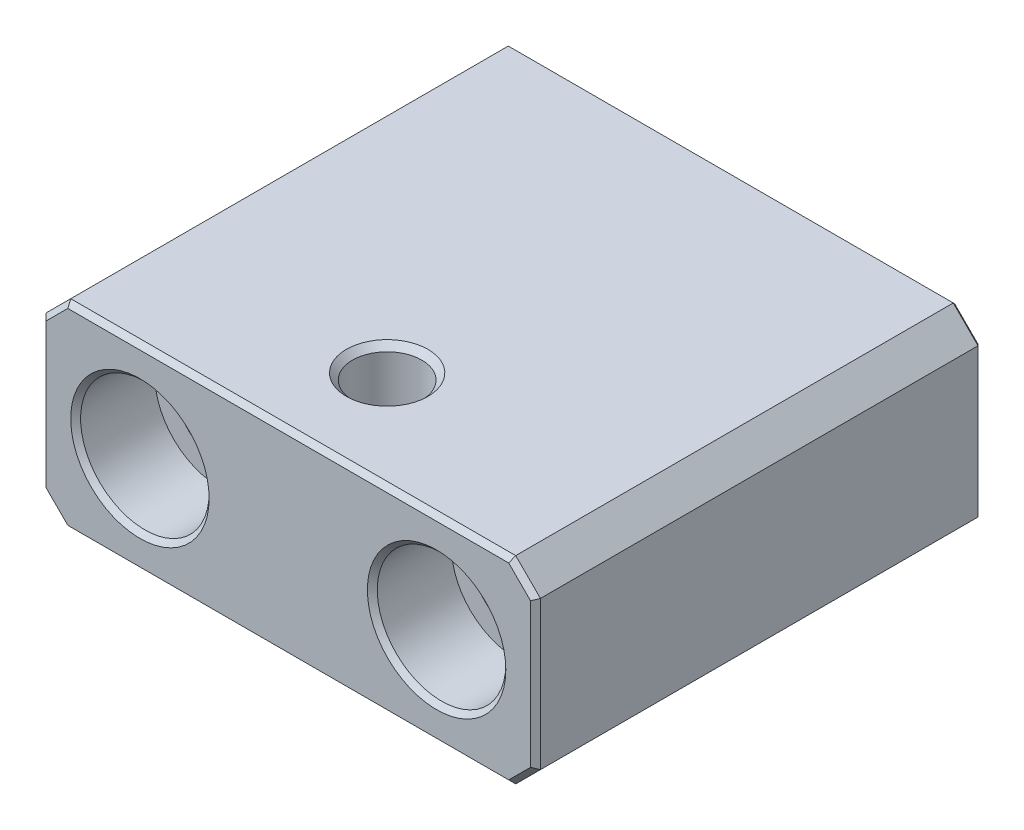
ISO-10303-21;
HEADER;
FILE_DESCRIPTION(('STEP AP214'),'2;1');
FILE_NAME('part.step','',(''),(''),'','','');
FILE_SCHEMA(('AUTOMOTIVE_DESIGN { 1 0 10303 214 1 1 1 1 }'));
ENDSEC;
DATA;
#1=APPLICATION_CONTEXT('core data for automotive mechanical design processes');
#2=APPLICATION_PROTOCOL_DEFINITION('international standard','automotive_design',2000,#1);
#3=PRODUCT_CONTEXT('',#1,'mechanical');
#4=PRODUCT('Part','Part','',(#3));
#5=PRODUCT_RELATED_PRODUCT_CATEGORY('part','',(#4));
#6=PRODUCT_DEFINITION_FORMATION('','',#4);
#7=PRODUCT_DEFINITION_CONTEXT('part definition',#1,'design');
#8=PRODUCT_DEFINITION('design','',#6,#7);
#9=PRODUCT_DEFINITION_SHAPE('','',#8);
#10=(LENGTH_UNIT() NAMED_UNIT(*) SI_UNIT(.MILLI.,.METRE.));
#11=(NAMED_UNIT(*) PLANE_ANGLE_UNIT() SI_UNIT($,.RADIAN.));
#12=(NAMED_UNIT(*) SI_UNIT($,.STERADIAN.) SOLID_ANGLE_UNIT());
#13=UNCERTAINTY_MEASURE_WITH_UNIT(LENGTH_MEASURE(1.E-05),#10,'distance_accuracy_value','');
#14=(GEOMETRIC_REPRESENTATION_CONTEXT(3) GLOBAL_UNCERTAINTY_ASSIGNED_CONTEXT((#13)) GLOBAL_UNIT_ASSIGNED_CONTEXT((#10,
#11,#12)) REPRESENTATION_CONTEXT('',''));
#15=CARTESIAN_POINT('',(0.,0.,0.));
#16=DIRECTION('',(0.,0.,1.));
#17=DIRECTION('',(1.,0.,0.));
#18=AXIS2_PLACEMENT_3D('',#15,#16,#17);
#19=CARTESIAN_POINT('',(50.,40.,90.));
#20=DIRECTION('',(0.,-1.,0.));
#21=DIRECTION('',(0.,0.,-1.));
#22=AXIS2_PLACEMENT_3D('',#19,#20,#21);
#23=PLANE('',#22);
#24=CARTESIAN_POINT('',(0.,40.,70.));
#25=DIRECTION('',(0.,-1.,0.));
#26=DIRECTION('',(0.,0.,-1.));
#27=AXIS2_PLACEMENT_3D('',#24,#25,#26);
#28=CIRCLE('',#27,8.24999999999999);
#29=CARTESIAN_POINT('',(0.,40.,61.75));
#30=VERTEX_POINT('',#29);
#31=EDGE_CURVE('E226',#30,#30,#28,.T.);
#32=ORIENTED_EDGE('',*,*,#31,.T.);
#33=EDGE_LOOP('',(#32));
#34=FACE_BOUND('',#33,.T.);
#35=DIRECTION('',(0.,0.,-1.));
#36=VECTOR('',#35,1.);
#37=CARTESIAN_POINT('',(45.,40.,90.));
#38=LINE('',#37,#36);
#39=CARTESIAN_POINT('',(45.,40.,89.));
#40=VERTEX_POINT('',#39);
#41=CARTESIAN_POINT('',(45.,40.,0.5));
#42=VERTEX_POINT('',#41);
#43=EDGE_CURVE('E305',#40,#42,#38,.T.);
#44=ORIENTED_EDGE('',*,*,#43,.T.);
#45=DIRECTION('',(-1.,0.,0.));
#46=VECTOR('',#45,1.);
#47=CARTESIAN_POINT('',(50.,40.,0.5));
#48=LINE('',#47,#46);
#49=CARTESIAN_POINT('',(-45.,40.,0.5));
#50=VERTEX_POINT('',#49);
#51=EDGE_CURVE('E262',#42,#50,#48,.T.);
#52=ORIENTED_EDGE('',*,*,#51,.T.);
#53=DIRECTION('',(0.,0.,1.));
#54=VECTOR('',#53,1.);
#55=CARTESIAN_POINT('',(-45.,40.,90.));
#56=LINE('',#55,#54);
#57=CARTESIAN_POINT('',(-45.,40.,89.));
#58=VERTEX_POINT('',#57);
#59=EDGE_CURVE('E309',#50,#58,#56,.T.);
#60=ORIENTED_EDGE('',*,*,#59,.T.);
#61=DIRECTION('',(1.,0.,0.));
#62=VECTOR('',#61,1.);
#63=CARTESIAN_POINT('',(45.,40.,89.));
#64=LINE('',#63,#62);
#65=EDGE_CURVE('E195',#58,#40,#64,.T.);
#66=ORIENTED_EDGE('',*,*,#65,.T.);
#67=EDGE_LOOP('',(#44,#52,#60,#66));
#68=FACE_BOUND('',#67,.T.);
#69=ADVANCED_FACE('F34',(#34,#68),#23,.F.);
#70=CARTESIAN_POINT('',(-50.,40.,90.));
#71=DIRECTION('',(1.,0.,0.));
#72=DIRECTION('',(0.,0.,-1.));
#73=AXIS2_PLACEMENT_3D('',#70,#71,#72);
#74=PLANE('',#73);
#75=DIRECTION('',(0.,0.,-1.));
#76=VECTOR('',#75,1.);
#77=CARTESIAN_POINT('',(-50.,35.,90.));
#78=LINE('',#77,#76);
#79=CARTESIAN_POINT('',(-50.,35.,89.));
#80=VERTEX_POINT('',#79);
#81=CARTESIAN_POINT('',(-50.,35.,0.5));
#82=VERTEX_POINT('',#81);
#83=EDGE_CURVE('E318',#80,#82,#78,.T.);
#84=ORIENTED_EDGE('',*,*,#83,.T.);
#85=DIRECTION('',(0.,-1.,0.));
#86=VECTOR('',#85,1.);
#87=CARTESIAN_POINT('',(-50.,40.,0.5));
#88=LINE('',#87,#86);
#89=CARTESIAN_POINT('',(-50.,5.00000000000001,0.5));
#90=VERTEX_POINT('',#89);
#91=EDGE_CURVE('E252',#82,#90,#88,.T.);
#92=ORIENTED_EDGE('',*,*,#91,.T.);
#93=DIRECTION('',(0.,0.,1.));
#94=VECTOR('',#93,1.);
#95=CARTESIAN_POINT('',(-50.,5.00000000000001,90.));
#96=LINE('',#95,#94);
#97=CARTESIAN_POINT('',(-50.,5.00000000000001,89.));
#98=VERTEX_POINT('',#97);
#99=EDGE_CURVE('E316',#90,#98,#96,.T.);
#100=ORIENTED_EDGE('',*,*,#99,.T.);
#101=DIRECTION('',(0.,1.,0.));
#102=VECTOR('',#101,1.);
#103=CARTESIAN_POINT('',(-50.,35.,89.));
#104=LINE('',#103,#102);
#105=EDGE_CURVE('E190',#98,#80,#104,.T.);
#106=ORIENTED_EDGE('',*,*,#105,.T.);
#107=EDGE_LOOP('',(#84,#92,#100,#106));
#108=FACE_BOUND('',#107,.T.);
#109=ADVANCED_FACE('F396',(#108),#74,.F.);
#110=CARTESIAN_POINT('',(-50.,0.,90.));
#111=DIRECTION('',(0.,1.,0.));
#112=DIRECTION('',(0.,0.,1.));
#113=AXIS2_PLACEMENT_3D('',#110,#111,#112);
#114=PLANE('',#113);
#115=CARTESIAN_POINT('',(0.,0.,70.));
#116=DIRECTION('',(0.,-1.,0.));
#117=DIRECTION('',(0.,0.,-1.));
#118=AXIS2_PLACEMENT_3D('',#115,#116,#117);
#119=CIRCLE('',#118,8.25);
#120=CARTESIAN_POINT('',(0.,0.,61.75));
#121=VERTEX_POINT('',#120);
#122=EDGE_CURVE('E515',#121,#121,#119,.T.);
#123=ORIENTED_EDGE('',*,*,#122,.F.);
#124=EDGE_LOOP('',(#123));
#125=FACE_BOUND('',#124,.T.);
#126=DIRECTION('',(0.,0.,-1.));
#127=VECTOR('',#126,1.);
#128=CARTESIAN_POINT('',(-45.,0.,90.));
#129=LINE('',#128,#127);
#130=CARTESIAN_POINT('',(-45.,0.,89.));
#131=VERTEX_POINT('',#130);
#132=CARTESIAN_POINT('',(-45.,0.,0.5));
#133=VERTEX_POINT('',#132);
#134=EDGE_CURVE('E307',#131,#133,#129,.T.);
#135=ORIENTED_EDGE('',*,*,#134,.T.);
#136=DIRECTION('',(1.,0.,0.));
#137=VECTOR('',#136,1.);
#138=CARTESIAN_POINT('',(-50.,0.,0.5));
#139=LINE('',#138,#137);
#140=CARTESIAN_POINT('',(45.,0.,0.5));
#141=VERTEX_POINT('',#140);
#142=EDGE_CURVE('E256',#133,#141,#139,.T.);
#143=ORIENTED_EDGE('',*,*,#142,.T.);
#144=DIRECTION('',(0.,0.,1.));
#145=VECTOR('',#144,1.);
#146=CARTESIAN_POINT('',(45.,0.,90.));
#147=LINE('',#146,#145);
#148=CARTESIAN_POINT('',(45.,0.,89.));
#149=VERTEX_POINT('',#148);
#150=EDGE_CURVE('E302',#141,#149,#147,.T.);
#151=ORIENTED_EDGE('',*,*,#150,.T.);
#152=DIRECTION('',(-1.,0.,0.));
#153=VECTOR('',#152,1.);
#154=CARTESIAN_POINT('',(-45.,0.,89.));
#155=LINE('',#154,#153);
#156=EDGE_CURVE('E180',#149,#131,#155,.T.);
#157=ORIENTED_EDGE('',*,*,#156,.T.);
#158=EDGE_LOOP('',(#135,#143,#151,#157));
#159=FACE_BOUND('',#158,.T.);
#160=ADVANCED_FACE('F344',(#125,#159),#114,.F.);
#161=CARTESIAN_POINT('',(50.,0.,90.));
#162=DIRECTION('',(-1.,0.,0.));
#163=DIRECTION('',(0.,0.,1.));
#164=AXIS2_PLACEMENT_3D('',#161,#162,#163);
#165=PLANE('',#164);
#166=DIRECTION('',(0.,0.,-1.));
#167=VECTOR('',#166,1.);
#168=CARTESIAN_POINT('',(50.,5.00000000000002,90.));
#169=LINE('',#168,#167);
#170=CARTESIAN_POINT('',(50.,5.00000000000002,89.));
#171=VERTEX_POINT('',#170);
#172=CARTESIAN_POINT('',(50.,5.00000000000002,0.5));
#173=VERTEX_POINT('',#172);
#174=EDGE_CURVE('E301',#171,#173,#169,.T.);
#175=ORIENTED_EDGE('',*,*,#174,.T.);
#176=DIRECTION('',(0.,1.,0.));
#177=VECTOR('',#176,1.);
#178=CARTESIAN_POINT('',(50.,0.,0.5));
#179=LINE('',#178,#177);
#180=CARTESIAN_POINT('',(50.,35.,0.5));
#181=VERTEX_POINT('',#180);
#182=EDGE_CURVE('E59',#173,#181,#179,.T.);
#183=ORIENTED_EDGE('',*,*,#182,.T.);
#184=DIRECTION('',(0.,0.,1.));
#185=VECTOR('',#184,1.);
#186=CARTESIAN_POINT('',(50.,35.,90.));
#187=LINE('',#186,#185);
#188=CARTESIAN_POINT('',(50.,35.,89.));
#189=VERTEX_POINT('',#188);
#190=EDGE_CURVE('E304',#181,#189,#187,.T.);
#191=ORIENTED_EDGE('',*,*,#190,.T.);
#192=DIRECTION('',(0.,-1.,0.));
#193=VECTOR('',#192,1.);
#194=CARTESIAN_POINT('',(50.,4.99999999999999,89.));
#195=LINE('',#194,#193);
#196=EDGE_CURVE('E200',#189,#171,#195,.T.);
#197=ORIENTED_EDGE('',*,*,#196,.T.);
#198=EDGE_LOOP('',(#175,#183,#191,#197));
#199=FACE_BOUND('',#198,.T.);
#200=ADVANCED_FACE('F303',(#199),#165,.F.);
#201=CARTESIAN_POINT('',(-50.,40.,90.));
#202=DIRECTION('',(0.,0.,1.));
#203=DIRECTION('',(1.,0.,0.));
#204=AXIS2_PLACEMENT_3D('',#201,#202,#203);
#205=PLANE('',#204);
#206=DIRECTION('',(1.,0.,0.));
#207=VECTOR('',#206,1.);
#208=CARTESIAN_POINT('',(45.,0.999999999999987,90.));
#209=LINE('',#208,#207);
#210=CARTESIAN_POINT('',(-44.5857864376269,0.999999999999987,90.));
#211=VERTEX_POINT('',#210);
#212=CARTESIAN_POINT('',(44.5857864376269,0.999999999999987,90.));
#213=VERTEX_POINT('',#212);
#214=EDGE_CURVE('E177',#211,#213,#209,.T.);
#215=ORIENTED_EDGE('',*,*,#214,.T.);
#216=DIRECTION('',(0.707106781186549,0.707106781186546,0.));
#217=VECTOR('',#216,1.);
#218=CARTESIAN_POINT('',(16.7928932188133,-26.7928932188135,90.));
#219=LINE('',#218,#217);
#220=CARTESIAN_POINT('',(49.,5.41421356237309,90.));
#221=VERTEX_POINT('',#220);
#222=EDGE_CURVE('E157',#213,#221,#219,.T.);
#223=ORIENTED_EDGE('',*,*,#222,.T.);
#224=DIRECTION('',(0.,1.,0.));
#225=VECTOR('',#224,1.);
#226=CARTESIAN_POINT('',(49.,35.,90.));
#227=LINE('',#226,#225);
#228=CARTESIAN_POINT('',(49.,34.5857864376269,90.));
#229=VERTEX_POINT('',#228);
#230=EDGE_CURVE('E165',#221,#229,#227,.T.);
#231=ORIENTED_EDGE('',*,*,#230,.T.);
#232=DIRECTION('',(-0.707106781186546,0.707106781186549,0.));
#233=VECTOR('',#232,1.);
#234=CARTESIAN_POINT('',(-3.20710678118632,86.7928932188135,90.));
#235=LINE('',#234,#233);
#236=CARTESIAN_POINT('',(44.5857864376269,39.,90.));
#237=VERTEX_POINT('',#236);
#238=EDGE_CURVE('E171',#229,#237,#235,.T.);
#239=ORIENTED_EDGE('',*,*,#238,.T.);
#240=DIRECTION('',(-1.,0.,0.));
#241=VECTOR('',#240,1.);
#242=CARTESIAN_POINT('',(-45.,39.,90.));
#243=LINE('',#242,#241);
#244=CARTESIAN_POINT('',(-44.5857864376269,39.,90.));
#245=VERTEX_POINT('',#244);
#246=EDGE_CURVE('E327',#237,#245,#243,.T.);
#247=ORIENTED_EDGE('',*,*,#246,.T.);
#248=DIRECTION('',(-0.707106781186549,-0.707106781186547,0.));
#249=VECTOR('',#248,1.);
#250=CARTESIAN_POINT('',(-46.7928932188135,36.7928932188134,90.));
#251=LINE('',#250,#249);
#252=CARTESIAN_POINT('',(-49.,34.5857864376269,90.));
#253=VERTEX_POINT('',#252);
#254=EDGE_CURVE('E329',#245,#253,#251,.T.);
#255=ORIENTED_EDGE('',*,*,#254,.T.);
#256=DIRECTION('',(0.,-1.,0.));
#257=VECTOR('',#256,1.);
#258=CARTESIAN_POINT('',(-49.,5.,90.));
#259=LINE('',#258,#257);
#260=CARTESIAN_POINT('',(-49.,5.4142135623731,90.));
#261=VERTEX_POINT('',#260);
#262=EDGE_CURVE('E331',#253,#261,#259,.T.);
#263=ORIENTED_EDGE('',*,*,#262,.T.);
#264=DIRECTION('',(0.707106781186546,-0.707106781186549,0.));
#265=VECTOR('',#264,1.);
#266=CARTESIAN_POINT('',(-66.7928932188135,23.2071067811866,90.));
#267=LINE('',#266,#265);
#268=EDGE_CURVE('E182',#261,#211,#267,.T.);
#269=ORIENTED_EDGE('',*,*,#268,.T.);
#270=EDGE_LOOP('',(#215,#223,#231,#239,#247,#255,#263,#269));
#271=FACE_BOUND('',#270,.T.);
#272=CARTESIAN_POINT('',(30.,20.,90.));
#273=DIRECTION('',(0.,0.,1.));
#274=DIRECTION('',(1.,0.,0.));
#275=AXIS2_PLACEMENT_3D('',#272,#273,#274);
#276=CIRCLE('',#275,14.);
#277=CARTESIAN_POINT('',(44.,20.,90.));
#278=VERTEX_POINT('',#277);
#279=EDGE_CURVE('E172',#278,#278,#276,.F.);
#280=ORIENTED_EDGE('',*,*,#279,.T.);
#281=EDGE_LOOP('',(#280));
#282=FACE_BOUND('',#281,.T.);
#283=CARTESIAN_POINT('',(-30.,20.,90.));
#284=DIRECTION('',(0.,0.,1.));
#285=DIRECTION('',(1.,0.,0.));
#286=AXIS2_PLACEMENT_3D('',#283,#284,#285);
#287=CIRCLE('',#286,14.);
#288=CARTESIAN_POINT('',(-16.,20.,90.));
#289=VERTEX_POINT('',#288);
#290=EDGE_CURVE('E321',#289,#289,#287,.F.);
#291=ORIENTED_EDGE('',*,*,#290,.T.);
#292=EDGE_LOOP('',(#291));
#293=FACE_BOUND('',#292,.T.);
#294=ADVANCED_FACE('F174',(#271,#282,#293),#205,.T.);
#295=CARTESIAN_POINT('',(-50.,40.,0.));
#296=DIRECTION('',(0.,0.,1.));
#297=DIRECTION('',(1.,0.,0.));
#298=AXIS2_PLACEMENT_3D('',#295,#296,#297);
#299=PLANE('',#298);
#300=DIRECTION('',(0.,1.,0.));
#301=VECTOR('',#300,1.);
#302=CARTESIAN_POINT('',(-49.5,40.,0.));
#303=LINE('',#302,#301);
#304=CARTESIAN_POINT('',(-49.5,5.20710678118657,0.));
#305=VERTEX_POINT('',#304);
#306=CARTESIAN_POINT('',(-49.5,34.7928932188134,0.));
#307=VERTEX_POINT('',#306);
#308=EDGE_CURVE('E244',#305,#307,#303,.T.);
#309=ORIENTED_EDGE('',*,*,#308,.T.);
#310=DIRECTION('',(0.707106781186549,0.707106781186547,0.));
#311=VECTOR('',#310,1.);
#312=CARTESIAN_POINT('',(-44.6464466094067,39.6464466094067,0.));
#313=LINE('',#312,#311);
#314=CARTESIAN_POINT('',(-44.7928932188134,39.5,0.));
#315=VERTEX_POINT('',#314);
#316=EDGE_CURVE('E246',#307,#315,#313,.T.);
#317=ORIENTED_EDGE('',*,*,#316,.T.);
#318=DIRECTION('',(1.,0.,0.));
#319=VECTOR('',#318,1.);
#320=CARTESIAN_POINT('',(-50.,39.5,0.));
#321=LINE('',#320,#319);
#322=CARTESIAN_POINT('',(44.7928932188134,39.5,0.));
#323=VERTEX_POINT('',#322);
#324=EDGE_CURVE('E232',#315,#323,#321,.T.);
#325=ORIENTED_EDGE('',*,*,#324,.T.);
#326=DIRECTION('',(0.707106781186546,-0.707106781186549,0.));
#327=VECTOR('',#326,1.);
#328=CARTESIAN_POINT('',(49.6464466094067,34.6464466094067,0.));
#329=LINE('',#328,#327);
#330=CARTESIAN_POINT('',(49.5,34.7928932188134,0.));
#331=VERTEX_POINT('',#330);
#332=EDGE_CURVE('E234',#323,#331,#329,.T.);
#333=ORIENTED_EDGE('',*,*,#332,.T.);
#334=DIRECTION('',(0.,-1.,0.));
#335=VECTOR('',#334,1.);
#336=CARTESIAN_POINT('',(49.5,40.,0.));
#337=LINE('',#336,#335);
#338=CARTESIAN_POINT('',(49.5,5.20710678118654,0.));
#339=VERTEX_POINT('',#338);
#340=EDGE_CURVE('E236',#331,#339,#337,.T.);
#341=ORIENTED_EDGE('',*,*,#340,.T.);
#342=DIRECTION('',(-0.707106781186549,-0.707106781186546,0.));
#343=VECTOR('',#342,1.);
#344=CARTESIAN_POINT('',(44.6464466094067,0.353553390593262,0.));
#345=LINE('',#344,#343);
#346=CARTESIAN_POINT('',(44.7928932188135,0.500000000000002,0.));
#347=VERTEX_POINT('',#346);
#348=EDGE_CURVE('E238',#339,#347,#345,.T.);
#349=ORIENTED_EDGE('',*,*,#348,.T.);
#350=DIRECTION('',(-1.,0.,0.));
#351=VECTOR('',#350,1.);
#352=CARTESIAN_POINT('',(-50.,0.5,0.));
#353=LINE('',#352,#351);
#354=CARTESIAN_POINT('',(-44.7928932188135,0.5,0.));
#355=VERTEX_POINT('',#354);
#356=EDGE_CURVE('E240',#347,#355,#353,.T.);
#357=ORIENTED_EDGE('',*,*,#356,.T.);
#358=DIRECTION('',(-0.707106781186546,0.707106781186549,0.));
#359=VECTOR('',#358,1.);
#360=CARTESIAN_POINT('',(-49.6464466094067,5.35355339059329,0.));
#361=LINE('',#360,#359);
#362=EDGE_CURVE('E242',#355,#305,#361,.T.);
#363=ORIENTED_EDGE('',*,*,#362,.T.);
#364=EDGE_LOOP('',(#309,#317,#325,#333,#341,#349,#357,#363));
#365=FACE_BOUND('',#364,.T.);
#366=CARTESIAN_POINT('',(30.,20.,0.));
#367=DIRECTION('',(0.,0.,1.));
#368=DIRECTION('',(1.,0.,0.));
#369=AXIS2_PLACEMENT_3D('',#366,#367,#368);
#370=CIRCLE('',#369,9.24999999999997);
#371=CARTESIAN_POINT('',(39.25,20.,0.));
#372=VERTEX_POINT('',#371);
#373=EDGE_CURVE('E229',#372,#372,#370,.T.);
#374=ORIENTED_EDGE('',*,*,#373,.T.);
#375=EDGE_LOOP('',(#374));
#376=FACE_BOUND('',#375,.T.);
#377=CARTESIAN_POINT('',(-30.,20.,0.));
#378=DIRECTION('',(0.,0.,1.));
#379=DIRECTION('',(1.,0.,0.));
#380=AXIS2_PLACEMENT_3D('',#377,#378,#379);
#381=CIRCLE('',#380,9.24999999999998);
#382=CARTESIAN_POINT('',(-20.75,20.,0.));
#383=VERTEX_POINT('',#382);
#384=EDGE_CURVE('E207',#383,#383,#381,.T.);
#385=ORIENTED_EDGE('',*,*,#384,.T.);
#386=EDGE_LOOP('',(#385));
#387=FACE_BOUND('',#386,.T.);
#388=ADVANCED_FACE('F361',(#365,#376,#387),#299,.F.);
#389=CARTESIAN_POINT('',(30.,20.,90.));
#390=DIRECTION('',(0.,0.,1.));
#391=DIRECTION('',(1.,0.,0.));
#392=AXIS2_PLACEMENT_3D('',#389,#390,#391);
#393=CYLINDRICAL_SURFACE('',#392,8.74999999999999);
#394=CARTESIAN_POINT('',(30.,20.,0.499999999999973));
#395=DIRECTION('',(0.,0.,1.));
#396=DIRECTION('',(1.,0.,0.));
#397=AXIS2_PLACEMENT_3D('',#394,#395,#396);
#398=CIRCLE('',#397,8.74999999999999);
#399=CARTESIAN_POINT('',(38.75,20.,0.499999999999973));
#400=VERTEX_POINT('',#399);
#401=EDGE_CURVE('E43',#400,#400,#398,.F.);
#402=ORIENTED_EDGE('',*,*,#401,.T.);
#403=EDGE_LOOP('',(#402));
#404=FACE_BOUND('',#403,.T.);
#405=CARTESIAN_POINT('',(30.,20.,74.));
#406=DIRECTION('',(0.,0.,1.));
#407=DIRECTION('',(1.,0.,0.));
#408=AXIS2_PLACEMENT_3D('',#405,#406,#407);
#409=CIRCLE('',#408,8.75000000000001);
#410=CARTESIAN_POINT('',(38.75,20.,74.));
#411=VERTEX_POINT('',#410);
#412=EDGE_CURVE('E382',#411,#411,#409,.T.);
#413=ORIENTED_EDGE('',*,*,#412,.T.);
#414=EDGE_LOOP('',(#413));
#415=FACE_BOUND('',#414,.T.);
#416=ADVANCED_FACE('F481',(#404,#415),#393,.F.);
#417=CARTESIAN_POINT('',(38.75,20.,74.));
#418=DIRECTION('',(0.,0.,-1.));
#419=DIRECTION('',(-1.,0.,0.));
#420=AXIS2_PLACEMENT_3D('',#417,#418,#419);
#421=PLANE('',#420);
#422=ORIENTED_EDGE('',*,*,#412,.F.);
#423=EDGE_LOOP('',(#422));
#424=FACE_BOUND('',#423,.T.);
#425=CARTESIAN_POINT('',(30.,20.,74.));
#426=DIRECTION('',(0.,0.,1.));
#427=DIRECTION('',(1.,0.,0.));
#428=AXIS2_PLACEMENT_3D('',#425,#426,#427);
#429=CIRCLE('',#428,13.);
#430=CARTESIAN_POINT('',(43.,20.,74.));
#431=VERTEX_POINT('',#430);
#432=EDGE_CURVE('E469',#431,#431,#429,.T.);
#433=ORIENTED_EDGE('',*,*,#432,.T.);
#434=EDGE_LOOP('',(#433));
#435=FACE_BOUND('',#434,.T.);
#436=ADVANCED_FACE('F483',(#424,#435),#421,.F.);
#437=CARTESIAN_POINT('',(30.,20.,90.));
#438=DIRECTION('',(0.,0.,1.));
#439=DIRECTION('',(1.,0.,0.));
#440=AXIS2_PLACEMENT_3D('',#437,#438,#439);
#441=CYLINDRICAL_SURFACE('',#440,13.);
#442=CARTESIAN_POINT('',(30.,20.,89.));
#443=DIRECTION('',(0.,0.,1.));
#444=DIRECTION('',(1.,0.,0.));
#445=AXIS2_PLACEMENT_3D('',#442,#443,#444);
#446=CIRCLE('',#445,13.);
#447=CARTESIAN_POINT('',(43.,20.,89.));
#448=VERTEX_POINT('',#447);
#449=EDGE_CURVE('E202',#448,#448,#446,.T.);
#450=ORIENTED_EDGE('',*,*,#449,.T.);
#451=EDGE_LOOP('',(#450));
#452=FACE_BOUND('',#451,.T.);
#453=ORIENTED_EDGE('',*,*,#432,.F.);
#454=EDGE_LOOP('',(#453));
#455=FACE_BOUND('',#454,.T.);
#456=ADVANCED_FACE('F486',(#452,#455),#441,.F.);
#457=CARTESIAN_POINT('',(-30.,20.,90.));
#458=DIRECTION('',(0.,0.,1.));
#459=DIRECTION('',(1.,0.,0.));
#460=AXIS2_PLACEMENT_3D('',#457,#458,#459);
#461=CYLINDRICAL_SURFACE('',#460,8.74999999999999);
#462=CARTESIAN_POINT('',(-30.,20.,0.499999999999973));
#463=DIRECTION('',(0.,0.,1.));
#464=DIRECTION('',(1.,0.,0.));
#465=AXIS2_PLACEMENT_3D('',#462,#463,#464);
#466=CIRCLE('',#465,8.74999999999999);
#467=CARTESIAN_POINT('',(-21.25,20.,0.499999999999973));
#468=VERTEX_POINT('',#467);
#469=EDGE_CURVE('E11',#468,#468,#466,.F.);
#470=ORIENTED_EDGE('',*,*,#469,.T.);
#471=EDGE_LOOP('',(#470));
#472=FACE_BOUND('',#471,.T.);
#473=CARTESIAN_POINT('',(-30.,20.,74.));
#474=DIRECTION('',(0.,0.,1.));
#475=DIRECTION('',(1.,0.,0.));
#476=AXIS2_PLACEMENT_3D('',#473,#474,#475);
#477=CIRCLE('',#476,8.75000000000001);
#478=CARTESIAN_POINT('',(-21.25,20.,74.));
#479=VERTEX_POINT('',#478);
#480=EDGE_CURVE('E465',#479,#479,#477,.T.);
#481=ORIENTED_EDGE('',*,*,#480,.T.);
#482=EDGE_LOOP('',(#481));
#483=FACE_BOUND('',#482,.T.);
#484=ADVANCED_FACE('F491',(#472,#483),#461,.F.);
#485=CARTESIAN_POINT('',(-21.25,20.,74.));
#486=DIRECTION('',(0.,0.,-1.));
#487=DIRECTION('',(-1.,0.,0.));
#488=AXIS2_PLACEMENT_3D('',#485,#486,#487);
#489=PLANE('',#488);
#490=ORIENTED_EDGE('',*,*,#480,.F.);
#491=EDGE_LOOP('',(#490));
#492=FACE_BOUND('',#491,.T.);
#493=CARTESIAN_POINT('',(-30.,20.,74.));
#494=DIRECTION('',(0.,0.,1.));
#495=DIRECTION('',(1.,0.,0.));
#496=AXIS2_PLACEMENT_3D('',#493,#494,#495);
#497=CIRCLE('',#496,13.);
#498=CARTESIAN_POINT('',(-17.,20.,74.));
#499=VERTEX_POINT('',#498);
#500=EDGE_CURVE('E463',#499,#499,#497,.T.);
#501=ORIENTED_EDGE('',*,*,#500,.T.);
#502=EDGE_LOOP('',(#501));
#503=FACE_BOUND('',#502,.T.);
#504=ADVANCED_FACE('F459',(#492,#503),#489,.F.);
#505=CARTESIAN_POINT('',(-30.,20.,90.));
#506=DIRECTION('',(0.,0.,1.));
#507=DIRECTION('',(1.,0.,0.));
#508=AXIS2_PLACEMENT_3D('',#505,#506,#507);
#509=CYLINDRICAL_SURFACE('',#508,13.);
#510=CARTESIAN_POINT('',(-30.,20.,89.));
#511=DIRECTION('',(0.,0.,1.));
#512=DIRECTION('',(1.,0.,0.));
#513=AXIS2_PLACEMENT_3D('',#510,#511,#512);
#514=CIRCLE('',#513,13.);
#515=CARTESIAN_POINT('',(-17.,20.,89.));
#516=VERTEX_POINT('',#515);
#517=EDGE_CURVE('E205',#516,#516,#514,.T.);
#518=ORIENTED_EDGE('',*,*,#517,.T.);
#519=EDGE_LOOP('',(#518));
#520=FACE_BOUND('',#519,.T.);
#521=ORIENTED_EDGE('',*,*,#500,.F.);
#522=EDGE_LOOP('',(#521));
#523=FACE_BOUND('',#522,.T.);
#524=ADVANCED_FACE('F455',(#520,#523),#509,.F.);
#525=CARTESIAN_POINT('',(0.,38.75,70.));
#526=DIRECTION('',(0.,1.,0.));
#527=DIRECTION('',(0.,0.,1.));
#528=AXIS2_PLACEMENT_3D('',#525,#526,#527);
#529=CONICAL_SURFACE('',#528,6.99999999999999,0.785398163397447);
#530=ORIENTED_EDGE('',*,*,#31,.F.);
#531=EDGE_LOOP('',(#530));
#532=FACE_BOUND('',#531,.T.);
#533=CARTESIAN_POINT('',(0.,38.75,70.));
#534=DIRECTION('',(0.,-1.,0.));
#535=DIRECTION('',(0.,0.,-1.));
#536=AXIS2_PLACEMENT_3D('',#533,#534,#535);
#537=CIRCLE('',#536,6.99999999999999);
#538=CARTESIAN_POINT('',(0.,38.75,63.));
#539=VERTEX_POINT('',#538);
#540=EDGE_CURVE('E466',#539,#539,#537,.T.);
#541=ORIENTED_EDGE('',*,*,#540,.T.);
#542=EDGE_LOOP('',(#541));
#543=FACE_BOUND('',#542,.T.);
#544=ADVANCED_FACE('F458',(#532,#543),#529,.F.);
#545=CARTESIAN_POINT('',(0.,0.,70.));
#546=DIRECTION('',(0.,-1.,0.));
#547=DIRECTION('',(0.,0.,-1.));
#548=AXIS2_PLACEMENT_3D('',#545,#546,#547);
#549=CYLINDRICAL_SURFACE('',#548,6.99999999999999);
#550=ORIENTED_EDGE('',*,*,#540,.F.);
#551=EDGE_LOOP('',(#550));
#552=FACE_BOUND('',#551,.T.);
#553=CARTESIAN_POINT('',(0.,1.25000000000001,70.));
#554=DIRECTION('',(0.,-1.,0.));
#555=DIRECTION('',(0.,0.,-1.));
#556=AXIS2_PLACEMENT_3D('',#553,#554,#555);
#557=CIRCLE('',#556,6.99999999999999);
#558=CARTESIAN_POINT('',(0.,1.25000000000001,63.));
#559=VERTEX_POINT('',#558);
#560=EDGE_CURVE('E472',#559,#559,#557,.T.);
#561=ORIENTED_EDGE('',*,*,#560,.T.);
#562=EDGE_LOOP('',(#561));
#563=FACE_BOUND('',#562,.T.);
#564=ADVANCED_FACE('F524',(#552,#563),#549,.F.);
#565=CARTESIAN_POINT('',(0.,0.,70.));
#566=DIRECTION('',(0.,-1.,0.));
#567=DIRECTION('',(0.,0.,-1.));
#568=AXIS2_PLACEMENT_3D('',#565,#566,#567);
#569=CONICAL_SURFACE('',#568,8.25,0.785398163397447);
#570=ORIENTED_EDGE('',*,*,#560,.F.);
#571=EDGE_LOOP('',(#570));
#572=FACE_BOUND('',#571,.T.);
#573=ORIENTED_EDGE('',*,*,#122,.T.);
#574=EDGE_LOOP('',(#573));
#575=FACE_BOUND('',#574,.T.);
#576=ADVANCED_FACE('F410',(#572,#575),#569,.F.);
#577=CARTESIAN_POINT('',(45.,40.,90.));
#578=DIRECTION('',(-0.707106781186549,-0.707106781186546,0.));
#579=DIRECTION('',(0.707106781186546,-0.707106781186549,0.));
#580=AXIS2_PLACEMENT_3D('',#577,#578,#579);
#581=PLANE('',#580);
#582=ORIENTED_EDGE('',*,*,#190,.F.);
#583=DIRECTION('',(0.707106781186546,-0.707106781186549,0.));
#584=VECTOR('',#583,1.);
#585=CARTESIAN_POINT('',(45.,40.,0.500000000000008));
#586=LINE('',#585,#584);
#587=EDGE_CURVE('E51',#181,#42,#586,.F.);
#588=ORIENTED_EDGE('',*,*,#587,.T.);
#589=ORIENTED_EDGE('',*,*,#43,.F.);
#590=DIRECTION('',(-0.707106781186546,0.707106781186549,0.));
#591=VECTOR('',#590,1.);
#592=CARTESIAN_POINT('',(45.,40.,89.));
#593=LINE('',#592,#591);
#594=EDGE_CURVE('E197',#40,#189,#593,.F.);
#595=ORIENTED_EDGE('',*,*,#594,.T.);
#596=EDGE_LOOP('',(#582,#588,#589,#595));
#597=FACE_BOUND('',#596,.T.);
#598=ADVANCED_FACE('F407',(#597),#581,.F.);
#599=CARTESIAN_POINT('',(50.,5.00000000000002,90.));
#600=DIRECTION('',(-0.707106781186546,0.707106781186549,0.));
#601=DIRECTION('',(-0.707106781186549,-0.707106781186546,0.));
#602=AXIS2_PLACEMENT_3D('',#599,#600,#601);
#603=PLANE('',#602);
#604=ORIENTED_EDGE('',*,*,#150,.F.);
#605=DIRECTION('',(-0.707106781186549,-0.707106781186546,0.));
#606=VECTOR('',#605,1.);
#607=CARTESIAN_POINT('',(50.,5.00000000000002,0.5));
#608=LINE('',#607,#606);
#609=EDGE_CURVE('E258',#141,#173,#608,.F.);
#610=ORIENTED_EDGE('',*,*,#609,.T.);
#611=ORIENTED_EDGE('',*,*,#174,.F.);
#612=DIRECTION('',(0.707106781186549,0.707106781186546,0.));
#613=VECTOR('',#612,1.);
#614=CARTESIAN_POINT('',(50.,5.00000000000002,89.));
#615=LINE('',#614,#613);
#616=EDGE_CURVE('E159',#171,#149,#615,.F.);
#617=ORIENTED_EDGE('',*,*,#616,.T.);
#618=EDGE_LOOP('',(#604,#610,#611,#617));
#619=FACE_BOUND('',#618,.T.);
#620=ADVANCED_FACE('F300',(#619),#603,.F.);
#621=CARTESIAN_POINT('',(-50.,35.,90.));
#622=DIRECTION('',(0.707106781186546,-0.707106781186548,0.));
#623=DIRECTION('',(0.707106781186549,0.707106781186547,0.));
#624=AXIS2_PLACEMENT_3D('',#621,#622,#623);
#625=PLANE('',#624);
#626=ORIENTED_EDGE('',*,*,#59,.F.);
#627=DIRECTION('',(0.707106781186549,0.707106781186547,0.));
#628=VECTOR('',#627,1.);
#629=CARTESIAN_POINT('',(-50.,35.,0.5));
#630=LINE('',#629,#628);
#631=EDGE_CURVE('E249',#50,#82,#630,.F.);
#632=ORIENTED_EDGE('',*,*,#631,.T.);
#633=ORIENTED_EDGE('',*,*,#83,.F.);
#634=DIRECTION('',(-0.707106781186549,-0.707106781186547,0.));
#635=VECTOR('',#634,1.);
#636=CARTESIAN_POINT('',(-50.,35.,89.));
#637=LINE('',#636,#635);
#638=EDGE_CURVE('E192',#80,#58,#637,.F.);
#639=ORIENTED_EDGE('',*,*,#638,.T.);
#640=EDGE_LOOP('',(#626,#632,#633,#639));
#641=FACE_BOUND('',#640,.T.);
#642=ADVANCED_FACE('F378',(#641),#625,.F.);
#643=CARTESIAN_POINT('',(-45.,0.,90.));
#644=DIRECTION('',(0.707106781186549,0.707106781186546,0.));
#645=DIRECTION('',(-0.707106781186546,0.707106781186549,0.));
#646=AXIS2_PLACEMENT_3D('',#643,#644,#645);
#647=PLANE('',#646);
#648=ORIENTED_EDGE('',*,*,#99,.F.);
#649=DIRECTION('',(-0.707106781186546,0.707106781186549,0.));
#650=VECTOR('',#649,1.);
#651=CARTESIAN_POINT('',(-45.,0.,0.499999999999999));
#652=LINE('',#651,#650);
#653=EDGE_CURVE('E254',#90,#133,#652,.F.);
#654=ORIENTED_EDGE('',*,*,#653,.T.);
#655=ORIENTED_EDGE('',*,*,#134,.F.);
#656=DIRECTION('',(0.707106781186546,-0.707106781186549,0.));
#657=VECTOR('',#656,1.);
#658=CARTESIAN_POINT('',(-45.,0.,89.));
#659=LINE('',#658,#657);
#660=EDGE_CURVE('E187',#131,#98,#659,.F.);
#661=ORIENTED_EDGE('',*,*,#660,.T.);
#662=EDGE_LOOP('',(#648,#654,#655,#661));
#663=FACE_BOUND('',#662,.T.);
#664=ADVANCED_FACE('F347',(#663),#647,.F.);
#665=CARTESIAN_POINT('',(-46.7928932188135,36.7928932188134,90.));
#666=DIRECTION('',(-0.500000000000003,0.500000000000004,0.707106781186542));
#667=DIRECTION('',(0.,-0.816496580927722,0.577350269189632));
#668=AXIS2_PLACEMENT_3D('',#665,#666,#667);
#669=PLANE('',#668);
#670=DIRECTION('',(0.281084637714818,-0.678598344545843,0.678598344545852));
#671=VECTOR('',#670,1.);
#672=CARTESIAN_POINT('',(-45.0135557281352,40.032726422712,88.967273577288));
#673=LINE('',#672,#671);
#674=EDGE_CURVE('E220',#58,#245,#673,.T.);
#675=ORIENTED_EDGE('',*,*,#674,.F.);
#676=ORIENTED_EDGE('',*,*,#638,.F.);
#677=DIRECTION('',(0.678598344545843,-0.281084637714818,0.678598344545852));
#678=VECTOR('',#677,1.);
#679=CARTESIAN_POINT('',(-48.4046282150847,34.3391753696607,90.5953717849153));
#680=LINE('',#679,#678);
#681=EDGE_CURVE('E223',#253,#80,#680,.F.);
#682=ORIENTED_EDGE('',*,*,#681,.F.);
#683=ORIENTED_EDGE('',*,*,#254,.F.);
#684=EDGE_LOOP('',(#675,#676,#682,#683));
#685=FACE_BOUND('',#684,.T.);
#686=ADVANCED_FACE('F417',(#685),#669,.T.);
#687=CARTESIAN_POINT('',(-49.,40.,90.));
#688=DIRECTION('',(-0.707106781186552,0.,0.707106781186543));
#689=DIRECTION('',(0.707106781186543,0.,0.707106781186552));
#690=AXIS2_PLACEMENT_3D('',#687,#688,#689);
#691=PLANE('',#690);
#692=ORIENTED_EDGE('',*,*,#681,.T.);
#693=ORIENTED_EDGE('',*,*,#105,.F.);
#694=DIRECTION('',(0.678598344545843,0.281084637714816,0.678598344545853));
#695=VECTOR('',#694,1.);
#696=CARTESIAN_POINT('',(-42.4029836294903,8.14678721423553,96.5970163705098));
#697=LINE('',#696,#695);
#698=EDGE_CURVE('E217',#261,#98,#697,.F.);
#699=ORIENTED_EDGE('',*,*,#698,.F.);
#700=ORIENTED_EDGE('',*,*,#262,.F.);
#701=EDGE_LOOP('',(#692,#693,#699,#700));
#702=FACE_BOUND('',#701,.T.);
#703=ADVANCED_FACE('F434',(#702),#691,.T.);
#704=CARTESIAN_POINT('',(-50.,39.,90.));
#705=DIRECTION('',(0.,0.707106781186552,0.707106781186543));
#706=DIRECTION('',(0.,-0.707106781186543,0.707106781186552));
#707=AXIS2_PLACEMENT_3D('',#704,#705,#706);
#708=PLANE('',#707);
#709=ORIENTED_EDGE('',*,*,#674,.T.);
#710=ORIENTED_EDGE('',*,*,#246,.F.);
#711=DIRECTION('',(-0.281084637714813,-0.678598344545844,0.678598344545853));
#712=VECTOR('',#711,1.);
#713=CARTESIAN_POINT('',(49.9259251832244,51.8922353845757,77.1077646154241));
#714=LINE('',#713,#712);
#715=EDGE_CURVE('E214',#40,#237,#714,.T.);
#716=ORIENTED_EDGE('',*,*,#715,.F.);
#717=ORIENTED_EDGE('',*,*,#65,.F.);
#718=EDGE_LOOP('',(#709,#710,#716,#717));
#719=FACE_BOUND('',#718,.T.);
#720=ADVANCED_FACE('F431',(#719),#708,.T.);
#721=CARTESIAN_POINT('',(-66.7928932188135,23.2071067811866,90.));
#722=DIRECTION('',(-0.500000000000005,-0.500000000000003,0.707106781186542));
#723=DIRECTION('',(0.816496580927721,0.,0.577350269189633));
#724=AXIS2_PLACEMENT_3D('',#721,#722,#723);
#725=PLANE('',#724);
#726=ORIENTED_EDGE('',*,*,#698,.T.);
#727=ORIENTED_EDGE('',*,*,#660,.F.);
#728=DIRECTION('',(0.281084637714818,0.678598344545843,0.678598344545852));
#729=VECTOR('',#728,1.);
#730=CARTESIAN_POINT('',(-42.1044754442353,6.9904146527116,95.9904146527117));
#731=LINE('',#730,#729);
#732=EDGE_CURVE('E211',#211,#131,#731,.F.);
#733=ORIENTED_EDGE('',*,*,#732,.F.);
#734=ORIENTED_EDGE('',*,*,#268,.F.);
#735=EDGE_LOOP('',(#726,#727,#733,#734));
#736=FACE_BOUND('',#735,.T.);
#737=ADVANCED_FACE('F338',(#736),#725,.T.);
#738=CARTESIAN_POINT('',(-3.20710678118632,86.7928932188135,90.));
#739=DIRECTION('',(0.500000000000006,0.500000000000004,0.70710678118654));
#740=DIRECTION('',(0.81649658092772,0.,-0.577350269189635));
#741=AXIS2_PLACEMENT_3D('',#738,#739,#740);
#742=PLANE('',#741);
#743=ORIENTED_EDGE('',*,*,#715,.T.);
#744=ORIENTED_EDGE('',*,*,#238,.F.);
#745=DIRECTION('',(-0.678598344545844,-0.281084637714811,0.678598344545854));
#746=VECTOR('',#745,1.);
#747=CARTESIAN_POINT('',(50.032726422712,35.0135557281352,88.967273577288));
#748=LINE('',#747,#746);
#749=EDGE_CURVE('E168',#189,#229,#748,.T.);
#750=ORIENTED_EDGE('',*,*,#749,.F.);
#751=ORIENTED_EDGE('',*,*,#594,.F.);
#752=EDGE_LOOP('',(#743,#744,#750,#751));
#753=FACE_BOUND('',#752,.T.);
#754=ADVANCED_FACE('F425',(#753),#742,.T.);
#755=CARTESIAN_POINT('',(-50.,0.999999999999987,90.));
#756=DIRECTION('',(0.,-0.707106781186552,0.707106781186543));
#757=DIRECTION('',(0.,-0.707106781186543,-0.707106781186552));
#758=AXIS2_PLACEMENT_3D('',#755,#756,#757);
#759=PLANE('',#758);
#760=ORIENTED_EDGE('',*,*,#732,.T.);
#761=ORIENTED_EDGE('',*,*,#156,.F.);
#762=DIRECTION('',(-0.281084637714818,0.678598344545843,0.678598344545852));
#763=VECTOR('',#762,1.);
#764=CARTESIAN_POINT('',(37.1126983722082,19.0416305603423,108.041630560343));
#765=LINE('',#764,#763);
#766=EDGE_CURVE('E162',#213,#149,#765,.F.);
#767=ORIENTED_EDGE('',*,*,#766,.F.);
#768=ORIENTED_EDGE('',*,*,#214,.F.);
#769=EDGE_LOOP('',(#760,#761,#767,#768));
#770=FACE_BOUND('',#769,.T.);
#771=ADVANCED_FACE('F341',(#770),#759,.T.);
#772=CARTESIAN_POINT('',(49.,40.,90.));
#773=DIRECTION('',(0.707106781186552,0.,0.707106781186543));
#774=DIRECTION('',(0.707106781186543,0.,-0.707106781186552));
#775=AXIS2_PLACEMENT_3D('',#772,#773,#774);
#776=PLANE('',#775);
#777=ORIENTED_EDGE('',*,*,#749,.T.);
#778=ORIENTED_EDGE('',*,*,#230,.F.);
#779=DIRECTION('',(0.678598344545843,-0.281084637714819,-0.678598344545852));
#780=VECTOR('',#779,1.);
#781=CARTESIAN_POINT('',(42.4029836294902,8.14678721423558,96.5970163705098));
#782=LINE('',#781,#780);
#783=EDGE_CURVE('E152',#171,#221,#782,.F.);
#784=ORIENTED_EDGE('',*,*,#783,.F.);
#785=ORIENTED_EDGE('',*,*,#196,.F.);
#786=EDGE_LOOP('',(#777,#778,#784,#785));
#787=FACE_BOUND('',#786,.T.);
#788=ADVANCED_FACE('F166',(#787),#776,.T.);
#789=CARTESIAN_POINT('',(16.7928932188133,-26.7928932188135,90.));
#790=DIRECTION('',(0.500000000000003,-0.500000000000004,0.707106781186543));
#791=DIRECTION('',(0.,-0.816496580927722,-0.577350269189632));
#792=AXIS2_PLACEMENT_3D('',#789,#790,#791);
#793=PLANE('',#792);
#794=ORIENTED_EDGE('',*,*,#766,.T.);
#795=ORIENTED_EDGE('',*,*,#616,.F.);
#796=ORIENTED_EDGE('',*,*,#783,.T.);
#797=ORIENTED_EDGE('',*,*,#222,.F.);
#798=EDGE_LOOP('',(#794,#795,#796,#797));
#799=FACE_BOUND('',#798,.T.);
#800=ADVANCED_FACE('F155',(#799),#793,.T.);
#801=CARTESIAN_POINT('',(30.,20.,89.));
#802=DIRECTION('',(0.,0.,1.));
#803=DIRECTION('',(1.,0.,0.));
#804=AXIS2_PLACEMENT_3D('',#801,#802,#803);
#805=CONICAL_SURFACE('',#804,13.,0.785398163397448);
#806=ORIENTED_EDGE('',*,*,#279,.F.);
#807=EDGE_LOOP('',(#806));
#808=FACE_BOUND('',#807,.T.);
#809=ORIENTED_EDGE('',*,*,#449,.F.);
#810=EDGE_LOOP('',(#809));
#811=FACE_BOUND('',#810,.T.);
#812=ADVANCED_FACE('F420',(#808,#811),#805,.F.);
#813=CARTESIAN_POINT('',(-30.,20.,89.));
#814=DIRECTION('',(0.,0.,1.));
#815=DIRECTION('',(1.,0.,0.));
#816=AXIS2_PLACEMENT_3D('',#813,#814,#815);
#817=CONICAL_SURFACE('',#816,13.,0.785398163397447);
#818=ORIENTED_EDGE('',*,*,#290,.F.);
#819=EDGE_LOOP('',(#818));
#820=FACE_BOUND('',#819,.T.);
#821=ORIENTED_EDGE('',*,*,#517,.F.);
#822=EDGE_LOOP('',(#821));
#823=FACE_BOUND('',#822,.T.);
#824=ADVANCED_FACE('F443',(#820,#823),#817,.F.);
#825=CARTESIAN_POINT('',(17.1464466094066,-27.1464466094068,0.));
#826=DIRECTION('',(-0.500000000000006,0.500000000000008,0.707106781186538));
#827=DIRECTION('',(0.,-0.816496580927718,0.577350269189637));
#828=AXIS2_PLACEMENT_3D('',#825,#826,#827);
#829=PLANE('',#828);
#830=DIRECTION('',(-0.678598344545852,0.281084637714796,-0.678598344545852));
#831=VECTOR('',#830,1.);
#832=CARTESIAN_POINT('',(50.9537178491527,4.60495713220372,1.45371784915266));
#833=LINE('',#832,#831);
#834=EDGE_CURVE('E281',#173,#339,#833,.T.);
#835=ORIENTED_EDGE('',*,*,#834,.F.);
#836=ORIENTED_EDGE('',*,*,#609,.F.);
#837=DIRECTION('',(-0.281084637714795,0.678598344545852,-0.678598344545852));
#838=VECTOR('',#837,1.);
#839=CARTESIAN_POINT('',(47.8819688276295,-6.95768823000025,7.45768823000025));
#840=LINE('',#839,#838);
#841=EDGE_CURVE('E38',#347,#141,#840,.F.);
#842=ORIENTED_EDGE('',*,*,#841,.F.);
#843=ORIENTED_EDGE('',*,*,#348,.F.);
#844=EDGE_LOOP('',(#835,#836,#842,#843));
#845=FACE_BOUND('',#844,.T.);
#846=ADVANCED_FACE('F296',(#845),#829,.F.);
#847=CARTESIAN_POINT('',(-50.,0.,0.5));
#848=DIRECTION('',(0.,0.707106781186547,0.707106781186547));
#849=DIRECTION('',(0.,-0.707106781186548,0.707106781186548));
#850=AXIS2_PLACEMENT_3D('',#847,#848,#849);
#851=PLANE('',#850);
#852=ORIENTED_EDGE('',*,*,#841,.T.);
#853=ORIENTED_EDGE('',*,*,#142,.F.);
#854=DIRECTION('',(0.281084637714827,0.678598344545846,-0.678598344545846));
#855=VECTOR('',#854,1.);
#856=CARTESIAN_POINT('',(-45.3950428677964,-0.95371784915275,1.45371784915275));
#857=LINE('',#856,#855);
#858=EDGE_CURVE('E279',#355,#133,#857,.F.);
#859=ORIENTED_EDGE('',*,*,#858,.F.);
#860=ORIENTED_EDGE('',*,*,#356,.F.);
#861=EDGE_LOOP('',(#852,#853,#859,#860));
#862=FACE_BOUND('',#861,.T.);
#863=ADVANCED_FACE('F291',(#862),#851,.F.);
#864=CARTESIAN_POINT('',(50.,0.,0.5));
#865=DIRECTION('',(-0.707106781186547,0.,0.707106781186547));
#866=DIRECTION('',(0.707106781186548,0.,0.707106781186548));
#867=AXIS2_PLACEMENT_3D('',#864,#865,#866);
#868=PLANE('',#867);
#869=ORIENTED_EDGE('',*,*,#834,.T.);
#870=ORIENTED_EDGE('',*,*,#340,.F.);
#871=DIRECTION('',(-0.678598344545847,-0.281084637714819,-0.678598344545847));
#872=VECTOR('',#871,1.);
#873=CARTESIAN_POINT('',(35.3775167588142,28.9431691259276,-14.1224832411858));
#874=LINE('',#873,#872);
#875=EDGE_CURVE('E276',#181,#331,#874,.T.);
#876=ORIENTED_EDGE('',*,*,#875,.F.);
#877=ORIENTED_EDGE('',*,*,#182,.F.);
#878=EDGE_LOOP('',(#869,#870,#876,#877));
#879=FACE_BOUND('',#878,.T.);
#880=ADVANCED_FACE('F365',(#879),#868,.F.);
#881=CARTESIAN_POINT('',(-67.1464466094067,22.8535533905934,0.));
#882=DIRECTION('',(0.499999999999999,0.499999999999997,0.70710678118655));
#883=DIRECTION('',(0.816496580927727,0.,-0.577350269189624));
#884=AXIS2_PLACEMENT_3D('',#881,#882,#883);
#885=PLANE('',#884);
#886=ORIENTED_EDGE('',*,*,#858,.T.);
#887=ORIENTED_EDGE('',*,*,#653,.F.);
#888=DIRECTION('',(0.678598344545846,0.281084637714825,-0.678598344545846));
#889=VECTOR('',#888,1.);
#890=CARTESIAN_POINT('',(-54.2601667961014,3.23538113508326,4.76016679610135));
#891=LINE('',#890,#889);
#892=EDGE_CURVE('E273',#305,#90,#891,.F.);
#893=ORIENTED_EDGE('',*,*,#892,.F.);
#894=ORIENTED_EDGE('',*,*,#362,.F.);
#895=EDGE_LOOP('',(#886,#887,#893,#894));
#896=FACE_BOUND('',#895,.T.);
#897=ADVANCED_FACE('F352',(#896),#885,.F.);
#898=CARTESIAN_POINT('',(-2.85355339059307,87.1464466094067,0.));
#899=DIRECTION('',(-0.500000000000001,-0.499999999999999,0.707106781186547));
#900=DIRECTION('',(0.816496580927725,0.,0.577350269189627));
#901=AXIS2_PLACEMENT_3D('',#898,#899,#900);
#902=PLANE('',#901);
#903=ORIENTED_EDGE('',*,*,#875,.T.);
#904=ORIENTED_EDGE('',*,*,#332,.F.);
#905=DIRECTION('',(-0.281084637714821,-0.678598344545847,-0.678598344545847));
#906=VECTOR('',#905,1.);
#907=CARTESIAN_POINT('',(45.3950428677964,40.9537178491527,1.45371784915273));
#908=LINE('',#907,#906);
#909=EDGE_CURVE('E270',#42,#323,#908,.T.);
#910=ORIENTED_EDGE('',*,*,#909,.F.);
#911=ORIENTED_EDGE('',*,*,#587,.F.);
#912=EDGE_LOOP('',(#903,#904,#910,#911));
#913=FACE_BOUND('',#912,.T.);
#914=ADVANCED_FACE('F367',(#913),#902,.F.);
#915=CARTESIAN_POINT('',(-50.,40.,0.5));
#916=DIRECTION('',(0.707106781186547,0.,0.707106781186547));
#917=DIRECTION('',(0.707106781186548,0.,-0.707106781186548));
#918=AXIS2_PLACEMENT_3D('',#915,#916,#917);
#919=PLANE('',#918);
#920=ORIENTED_EDGE('',*,*,#892,.T.);
#921=ORIENTED_EDGE('',*,*,#91,.F.);
#922=DIRECTION('',(0.678598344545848,-0.281084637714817,-0.678598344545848));
#923=VECTOR('',#922,1.);
#924=CARTESIAN_POINT('',(-50.9537178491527,35.3950428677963,1.45371784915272));
#925=LINE('',#924,#923);
#926=EDGE_CURVE('E268',#307,#82,#925,.F.);
#927=ORIENTED_EDGE('',*,*,#926,.F.);
#928=ORIENTED_EDGE('',*,*,#308,.F.);
#929=EDGE_LOOP('',(#920,#921,#927,#928));
#930=FACE_BOUND('',#929,.T.);
#931=ADVANCED_FACE('F357',(#930),#919,.F.);
#932=CARTESIAN_POINT('',(50.,40.,0.5));
#933=DIRECTION('',(0.,-0.707106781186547,0.707106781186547));
#934=DIRECTION('',(0.,-0.707106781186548,-0.707106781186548));
#935=AXIS2_PLACEMENT_3D('',#932,#933,#934);
#936=PLANE('',#935);
#937=ORIENTED_EDGE('',*,*,#909,.T.);
#938=ORIENTED_EDGE('',*,*,#324,.F.);
#939=DIRECTION('',(-0.281084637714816,0.678598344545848,0.678598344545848));
#940=VECTOR('',#939,1.);
#941=CARTESIAN_POINT('',(-37.4941855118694,21.8793608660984,-17.6206391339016));
#942=LINE('',#941,#940);
#943=EDGE_CURVE('E266',#50,#315,#942,.F.);
#944=ORIENTED_EDGE('',*,*,#943,.F.);
#945=ORIENTED_EDGE('',*,*,#51,.F.);
#946=EDGE_LOOP('',(#937,#938,#944,#945));
#947=FACE_BOUND('',#946,.T.);
#948=ADVANCED_FACE('F373',(#947),#936,.F.);
#949=CARTESIAN_POINT('',(-47.1464466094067,37.1464466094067,0.));
#950=DIRECTION('',(0.5,-0.500000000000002,0.707106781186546));
#951=DIRECTION('',(0.,-0.816496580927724,-0.577350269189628));
#952=AXIS2_PLACEMENT_3D('',#949,#950,#951);
#953=PLANE('',#952);
#954=ORIENTED_EDGE('',*,*,#926,.T.);
#955=ORIENTED_EDGE('',*,*,#631,.F.);
#956=ORIENTED_EDGE('',*,*,#943,.T.);
#957=ORIENTED_EDGE('',*,*,#316,.F.);
#958=EDGE_LOOP('',(#954,#955,#956,#957));
#959=FACE_BOUND('',#958,.T.);
#960=ADVANCED_FACE('F384',(#959),#953,.F.);
#961=CARTESIAN_POINT('',(30.,20.,0.));
#962=DIRECTION('',(0.,0.,-1.));
#963=DIRECTION('',(-1.,0.,0.));
#964=AXIS2_PLACEMENT_3D('',#961,#962,#963);
#965=CONICAL_SURFACE('',#964,9.24999999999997,0.785398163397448);
#966=ORIENTED_EDGE('',*,*,#401,.F.);
#967=EDGE_LOOP('',(#966));
#968=FACE_BOUND('',#967,.T.);
#969=ORIENTED_EDGE('',*,*,#373,.F.);
#970=EDGE_LOOP('',(#969));
#971=FACE_BOUND('',#970,.T.);
#972=ADVANCED_FACE('F386',(#968,#971),#965,.F.);
#973=CARTESIAN_POINT('',(-30.,20.,0.));
#974=DIRECTION('',(0.,0.,-1.));
#975=DIRECTION('',(-1.,0.,0.));
#976=AXIS2_PLACEMENT_3D('',#973,#974,#975);
#977=CONICAL_SURFACE('',#976,9.24999999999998,0.78539816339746);
#978=ORIENTED_EDGE('',*,*,#469,.F.);
#979=EDGE_LOOP('',(#978));
#980=FACE_BOUND('',#979,.T.);
#981=ORIENTED_EDGE('',*,*,#384,.F.);
#982=EDGE_LOOP('',(#981));
#983=FACE_BOUND('',#982,.T.);
#984=ADVANCED_FACE('F36',(#980,#983),#977,.F.);
#985=CLOSED_SHELL('',(#69,#109,#160,#200,#294,#388,#416,#436,#456,#484,#504,#524,#544,#564,#576,
#598,#620,#642,#664,#686,#703,#720,#737,#754,#771,#788,#800,#812,#824,#846,#863,#880,#897,#914,
#931,#948,#960,#972,#984));
#986=MANIFOLD_SOLID_BREP('B2',#985);
#987=ADVANCED_BREP_SHAPE_REPRESENTATION('',(#18,#986),#14);
#988=SHAPE_DEFINITION_REPRESENTATION(#9,#987);
ENDSEC;
END-ISO-10303-21;
